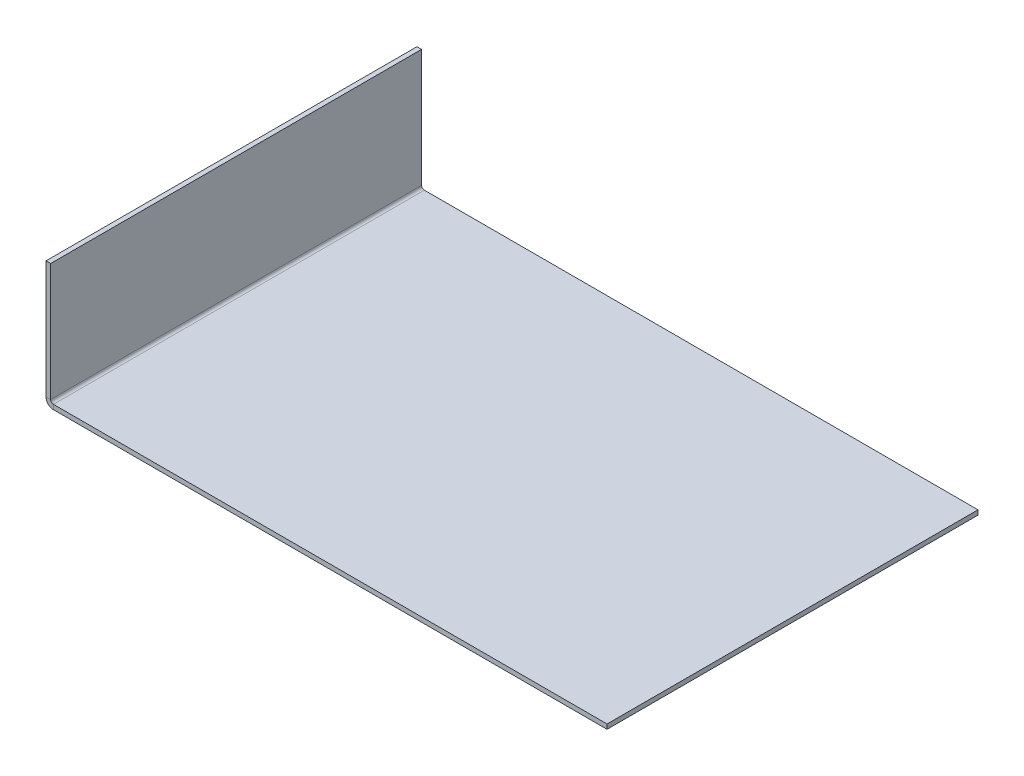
ISO-10303-21;
HEADER;
FILE_DESCRIPTION(('STEP AP214'),'2;1');
FILE_NAME('part.step','',(''),(''),'','','');
FILE_SCHEMA(('AUTOMOTIVE_DESIGN { 1 0 10303 214 1 1 1 1 }'));
ENDSEC;
DATA;
#1=APPLICATION_CONTEXT('core data for automotive mechanical design processes');
#2=APPLICATION_PROTOCOL_DEFINITION('international standard','automotive_design',2000,#1);
#3=PRODUCT_CONTEXT('',#1,'mechanical');
#4=PRODUCT('Part','Part','',(#3));
#5=PRODUCT_RELATED_PRODUCT_CATEGORY('part','',(#4));
#6=PRODUCT_DEFINITION_FORMATION('','',#4);
#7=PRODUCT_DEFINITION_CONTEXT('part definition',#1,'design');
#8=PRODUCT_DEFINITION('design','',#6,#7);
#9=PRODUCT_DEFINITION_SHAPE('','',#8);
#10=(LENGTH_UNIT() NAMED_UNIT(*) SI_UNIT(.MILLI.,.METRE.));
#11=(NAMED_UNIT(*) PLANE_ANGLE_UNIT() SI_UNIT($,.RADIAN.));
#12=(NAMED_UNIT(*) SI_UNIT($,.STERADIAN.) SOLID_ANGLE_UNIT());
#13=UNCERTAINTY_MEASURE_WITH_UNIT(LENGTH_MEASURE(1.E-05),#10,'distance_accuracy_value','');
#14=(GEOMETRIC_REPRESENTATION_CONTEXT(3) GLOBAL_UNCERTAINTY_ASSIGNED_CONTEXT((#13)) GLOBAL_UNIT_ASSIGNED_CONTEXT((#10,
#11,#12)) REPRESENTATION_CONTEXT('',''));
#15=CARTESIAN_POINT('',(0.,0.,0.));
#16=DIRECTION('',(0.,0.,1.));
#17=DIRECTION('',(1.,0.,0.));
#18=AXIS2_PLACEMENT_3D('',#15,#16,#17);
#19=CARTESIAN_POINT('',(-76.2,1.27,50.8));
#20=DIRECTION('',(0.,0.,-1.));
#21=DIRECTION('',(-1.,0.,0.));
#22=AXIS2_PLACEMENT_3D('',#19,#20,#21);
#23=PLANE('',#22);
#24=DIRECTION('',(0.,-1.,0.));
#25=VECTOR('',#24,1.);
#26=CARTESIAN_POINT('',(-75.438,1.27,50.8));
#27=LINE('',#26,#25);
#28=CARTESIAN_POINT('',(-75.438,1.27,50.8));
#29=VERTEX_POINT('',#28);
#30=CARTESIAN_POINT('',(-75.438,0.,50.8));
#31=VERTEX_POINT('',#30);
#32=EDGE_CURVE('E147',#29,#31,#27,.T.);
#33=ORIENTED_EDGE('',*,*,#32,.T.);
#34=DIRECTION('',(1.,0.,0.));
#35=VECTOR('',#34,1.);
#36=CARTESIAN_POINT('',(-76.2,0.,50.8));
#37=LINE('',#36,#35);
#38=CARTESIAN_POINT('',(76.2,0.,50.8));
#39=VERTEX_POINT('',#38);
#40=EDGE_CURVE('E150',#31,#39,#37,.T.);
#41=ORIENTED_EDGE('',*,*,#40,.T.);
#42=DIRECTION('',(0.,-1.,0.));
#43=VECTOR('',#42,1.);
#44=CARTESIAN_POINT('',(76.2,1.27,50.8));
#45=LINE('',#44,#43);
#46=CARTESIAN_POINT('',(76.2,1.27,50.8));
#47=VERTEX_POINT('',#46);
#48=EDGE_CURVE('E11',#47,#39,#45,.T.);
#49=ORIENTED_EDGE('',*,*,#48,.F.);
#50=DIRECTION('',(1.,0.,0.));
#51=VECTOR('',#50,1.);
#52=CARTESIAN_POINT('',(-76.2,1.27,50.8));
#53=LINE('',#52,#51);
#54=EDGE_CURVE('E157',#29,#47,#53,.T.);
#55=ORIENTED_EDGE('',*,*,#54,.F.);
#56=EDGE_LOOP('',(#33,#41,#49,#55));
#57=FACE_BOUND('',#56,.T.);
#58=ADVANCED_FACE('F28',(#57),#23,.F.);
#59=CARTESIAN_POINT('',(-76.2,1.27,-50.8));
#60=DIRECTION('',(0.,0.,1.));
#61=DIRECTION('',(1.,0.,0.));
#62=AXIS2_PLACEMENT_3D('',#59,#60,#61);
#63=PLANE('',#62);
#64=DIRECTION('',(0.,-1.,0.));
#65=VECTOR('',#64,1.);
#66=CARTESIAN_POINT('',(-75.438,1.27,-50.8));
#67=LINE('',#66,#65);
#68=CARTESIAN_POINT('',(-75.438,1.27,-50.8));
#69=VERTEX_POINT('',#68);
#70=CARTESIAN_POINT('',(-75.438,0.,-50.8));
#71=VERTEX_POINT('',#70);
#72=EDGE_CURVE('E42',#69,#71,#67,.T.);
#73=ORIENTED_EDGE('',*,*,#72,.F.);
#74=DIRECTION('',(-1.,0.,0.));
#75=VECTOR('',#74,1.);
#76=CARTESIAN_POINT('',(-76.2,1.27,-50.8));
#77=LINE('',#76,#75);
#78=CARTESIAN_POINT('',(76.2,1.27,-50.8));
#79=VERTEX_POINT('',#78);
#80=EDGE_CURVE('E161',#79,#69,#77,.T.);
#81=ORIENTED_EDGE('',*,*,#80,.F.);
#82=DIRECTION('',(0.,-1.,0.));
#83=VECTOR('',#82,1.);
#84=CARTESIAN_POINT('',(76.2,1.27,-50.8));
#85=LINE('',#84,#83);
#86=CARTESIAN_POINT('',(76.2,0.,-50.8));
#87=VERTEX_POINT('',#86);
#88=EDGE_CURVE('E35',#79,#87,#85,.T.);
#89=ORIENTED_EDGE('',*,*,#88,.T.);
#90=DIRECTION('',(-1.,0.,0.));
#91=VECTOR('',#90,1.);
#92=CARTESIAN_POINT('',(-76.2,0.,-50.8));
#93=LINE('',#92,#91);
#94=EDGE_CURVE('E155',#87,#71,#93,.T.);
#95=ORIENTED_EDGE('',*,*,#94,.T.);
#96=EDGE_LOOP('',(#73,#81,#89,#95));
#97=FACE_BOUND('',#96,.T.);
#98=ADVANCED_FACE('F165',(#97),#63,.F.);
#99=CARTESIAN_POINT('',(-76.2,1.27,50.8));
#100=DIRECTION('',(0.,1.,0.));
#101=DIRECTION('',(0.,0.,1.));
#102=AXIS2_PLACEMENT_3D('',#99,#100,#101);
#103=PLANE('',#102);
#104=ORIENTED_EDGE('',*,*,#80,.T.);
#105=DIRECTION('',(0.,0.,1.));
#106=VECTOR('',#105,1.);
#107=CARTESIAN_POINT('',(-75.438,1.27,50.8));
#108=LINE('',#107,#106);
#109=EDGE_CURVE('E49',#29,#69,#108,.F.);
#110=ORIENTED_EDGE('',*,*,#109,.F.);
#111=ORIENTED_EDGE('',*,*,#54,.T.);
#112=DIRECTION('',(0.,0.,-1.));
#113=VECTOR('',#112,1.);
#114=CARTESIAN_POINT('',(76.2,1.27,-50.8));
#115=LINE('',#114,#113);
#116=EDGE_CURVE('E159',#47,#79,#115,.T.);
#117=ORIENTED_EDGE('',*,*,#116,.T.);
#118=EDGE_LOOP('',(#104,#110,#111,#117));
#119=FACE_BOUND('',#118,.T.);
#120=ADVANCED_FACE('F175',(#119),#103,.T.);
#121=CARTESIAN_POINT('',(-76.2,0.,50.8));
#122=DIRECTION('',(0.,1.,0.));
#123=DIRECTION('',(0.,0.,1.));
#124=AXIS2_PLACEMENT_3D('',#121,#122,#123);
#125=PLANE('',#124);
#126=DIRECTION('',(0.,0.,1.));
#127=VECTOR('',#126,1.);
#128=CARTESIAN_POINT('',(-75.438,0.,50.8));
#129=LINE('',#128,#127);
#130=EDGE_CURVE('E101',#31,#71,#129,.F.);
#131=ORIENTED_EDGE('',*,*,#130,.T.);
#132=ORIENTED_EDGE('',*,*,#94,.F.);
#133=DIRECTION('',(0.,0.,-1.));
#134=VECTOR('',#133,1.);
#135=CARTESIAN_POINT('',(76.2,0.,-50.8));
#136=LINE('',#135,#134);
#137=EDGE_CURVE('E153',#39,#87,#136,.T.);
#138=ORIENTED_EDGE('',*,*,#137,.F.);
#139=ORIENTED_EDGE('',*,*,#40,.F.);
#140=EDGE_LOOP('',(#131,#132,#138,#139));
#141=FACE_BOUND('',#140,.T.);
#142=ADVANCED_FACE('F170',(#141),#125,.F.);
#143=CARTESIAN_POINT('',(76.2,1.27,-50.8));
#144=DIRECTION('',(-1.,0.,0.));
#145=DIRECTION('',(0.,0.,1.));
#146=AXIS2_PLACEMENT_3D('',#143,#144,#145);
#147=PLANE('',#146);
#148=ORIENTED_EDGE('',*,*,#137,.T.);
#149=ORIENTED_EDGE('',*,*,#88,.F.);
#150=ORIENTED_EDGE('',*,*,#116,.F.);
#151=ORIENTED_EDGE('',*,*,#48,.T.);
#152=EDGE_LOOP('',(#148,#149,#150,#151));
#153=FACE_BOUND('',#152,.T.);
#154=ADVANCED_FACE('F174',(#153),#147,.F.);
#155=CARTESIAN_POINT('',(-75.438,2.03199999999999,-50.8));
#156=DIRECTION('',(0.,0.,-1.));
#157=DIRECTION('',(-1.,0.,0.));
#158=AXIS2_PLACEMENT_3D('',#155,#156,#157);
#159=PLANE('',#158);
#160=DIRECTION('',(-1.,0.,0.));
#161=VECTOR('',#160,1.);
#162=CARTESIAN_POINT('',(-76.2,2.03199999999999,-50.8));
#163=LINE('',#162,#161);
#164=CARTESIAN_POINT('',(-76.2,2.03199999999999,-50.8));
#165=VERTEX_POINT('',#164);
#166=CARTESIAN_POINT('',(-77.47,2.03199999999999,-50.8));
#167=VERTEX_POINT('',#166);
#168=EDGE_CURVE('E183',#165,#167,#163,.T.);
#169=ORIENTED_EDGE('',*,*,#168,.F.);
#170=CARTESIAN_POINT('',(-75.438,2.03199999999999,-50.8));
#171=DIRECTION('',(0.,0.,1.));
#172=DIRECTION('',(1.,0.,0.));
#173=AXIS2_PLACEMENT_3D('',#170,#171,#172);
#174=CIRCLE('',#173,0.761999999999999);
#175=EDGE_CURVE('E104',#69,#165,#174,.F.);
#176=ORIENTED_EDGE('',*,*,#175,.F.);
#177=ORIENTED_EDGE('',*,*,#72,.T.);
#178=CARTESIAN_POINT('',(-75.438,2.03199999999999,-50.8));
#179=DIRECTION('',(0.,0.,1.));
#180=DIRECTION('',(1.,0.,0.));
#181=AXIS2_PLACEMENT_3D('',#178,#179,#180);
#182=CIRCLE('',#181,2.032);
#183=EDGE_CURVE('E146',#71,#167,#182,.F.);
#184=ORIENTED_EDGE('',*,*,#183,.T.);
#185=EDGE_LOOP('',(#169,#176,#177,#184));
#186=FACE_BOUND('',#185,.T.);
#187=ADVANCED_FACE('F216',(#186),#159,.T.);
#188=CARTESIAN_POINT('',(-75.438,2.03199999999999,50.8));
#189=DIRECTION('',(0.,0.,-1.));
#190=DIRECTION('',(-1.,0.,0.));
#191=AXIS2_PLACEMENT_3D('',#188,#189,#190);
#192=PLANE('',#191);
#193=CARTESIAN_POINT('',(-75.438,2.03199999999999,50.8));
#194=DIRECTION('',(0.,0.,1.));
#195=DIRECTION('',(1.,0.,0.));
#196=AXIS2_PLACEMENT_3D('',#193,#194,#195);
#197=CIRCLE('',#196,0.761999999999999);
#198=CARTESIAN_POINT('',(-76.2,2.03199999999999,50.8));
#199=VERTEX_POINT('',#198);
#200=EDGE_CURVE('E111',#199,#29,#197,.T.);
#201=ORIENTED_EDGE('',*,*,#200,.F.);
#202=DIRECTION('',(-1.,0.,0.));
#203=VECTOR('',#202,1.);
#204=CARTESIAN_POINT('',(-76.2,2.03199999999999,50.8));
#205=LINE('',#204,#203);
#206=CARTESIAN_POINT('',(-77.47,2.03199999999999,50.8));
#207=VERTEX_POINT('',#206);
#208=EDGE_CURVE('E108',#199,#207,#205,.T.);
#209=ORIENTED_EDGE('',*,*,#208,.T.);
#210=CARTESIAN_POINT('',(-75.438,2.03199999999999,50.8));
#211=DIRECTION('',(0.,0.,1.));
#212=DIRECTION('',(1.,0.,0.));
#213=AXIS2_PLACEMENT_3D('',#210,#211,#212);
#214=CIRCLE('',#213,2.032);
#215=EDGE_CURVE('E94',#207,#31,#214,.T.);
#216=ORIENTED_EDGE('',*,*,#215,.T.);
#217=ORIENTED_EDGE('',*,*,#32,.F.);
#218=EDGE_LOOP('',(#201,#209,#216,#217));
#219=FACE_BOUND('',#218,.T.);
#220=ADVANCED_FACE('F109',(#219),#192,.F.);
#221=CARTESIAN_POINT('',(-75.438,2.03199999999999,50.8));
#222=DIRECTION('',(0.,0.,1.));
#223=DIRECTION('',(-1.,0.,0.));
#224=AXIS2_PLACEMENT_3D('',#221,#222,#223);
#225=CYLINDRICAL_SURFACE('',#224,2.032);
#226=ORIENTED_EDGE('',*,*,#130,.F.);
#227=ORIENTED_EDGE('',*,*,#215,.F.);
#228=DIRECTION('',(0.,0.,-1.));
#229=VECTOR('',#228,1.);
#230=CARTESIAN_POINT('',(-77.47,2.03199999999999,-50.8));
#231=LINE('',#230,#229);
#232=EDGE_CURVE('E99',#207,#167,#231,.T.);
#233=ORIENTED_EDGE('',*,*,#232,.T.);
#234=ORIENTED_EDGE('',*,*,#183,.F.);
#235=EDGE_LOOP('',(#226,#227,#233,#234));
#236=FACE_BOUND('',#235,.T.);
#237=ADVANCED_FACE('F96',(#236),#225,.T.);
#238=CARTESIAN_POINT('',(-75.438,2.03199999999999,50.8));
#239=DIRECTION('',(0.,0.,1.));
#240=DIRECTION('',(-1.,0.,0.));
#241=AXIS2_PLACEMENT_3D('',#238,#239,#240);
#242=CYLINDRICAL_SURFACE('',#241,0.761999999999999);
#243=ORIENTED_EDGE('',*,*,#109,.T.);
#244=ORIENTED_EDGE('',*,*,#175,.T.);
#245=DIRECTION('',(0.,0.,1.));
#246=VECTOR('',#245,1.);
#247=CARTESIAN_POINT('',(-76.2,2.03199999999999,-50.8));
#248=LINE('',#247,#246);
#249=EDGE_CURVE('E115',#165,#199,#248,.T.);
#250=ORIENTED_EDGE('',*,*,#249,.T.);
#251=ORIENTED_EDGE('',*,*,#200,.T.);
#252=EDGE_LOOP('',(#243,#244,#250,#251));
#253=FACE_BOUND('',#252,.T.);
#254=ADVANCED_FACE('F177',(#253),#242,.F.);
#255=CARTESIAN_POINT('',(-77.47,1.27,-50.8));
#256=DIRECTION('',(0.,0.,1.));
#257=DIRECTION('',(1.,0.,0.));
#258=AXIS2_PLACEMENT_3D('',#255,#256,#257);
#259=PLANE('',#258);
#260=ORIENTED_EDGE('',*,*,#168,.T.);
#261=DIRECTION('',(0.,-1.,0.));
#262=VECTOR('',#261,1.);
#263=CARTESIAN_POINT('',(-77.47,1.27,-50.8));
#264=LINE('',#263,#262);
#265=CARTESIAN_POINT('',(-77.4700000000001,34.29,-50.8));
#266=VERTEX_POINT('',#265);
#267=EDGE_CURVE('E123',#266,#167,#264,.T.);
#268=ORIENTED_EDGE('',*,*,#267,.F.);
#269=DIRECTION('',(1.,0.,0.));
#270=VECTOR('',#269,1.);
#271=CARTESIAN_POINT('',(-77.4700000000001,34.29,-50.8));
#272=LINE('',#271,#270);
#273=CARTESIAN_POINT('',(-76.2000000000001,34.29,-50.8));
#274=VERTEX_POINT('',#273);
#275=EDGE_CURVE('E132',#266,#274,#272,.T.);
#276=ORIENTED_EDGE('',*,*,#275,.T.);
#277=DIRECTION('',(0.,-1.,0.));
#278=VECTOR('',#277,1.);
#279=CARTESIAN_POINT('',(-76.2,1.27,-50.8));
#280=LINE('',#279,#278);
#281=EDGE_CURVE('E124',#274,#165,#280,.T.);
#282=ORIENTED_EDGE('',*,*,#281,.T.);
#283=EDGE_LOOP('',(#260,#268,#276,#282));
#284=FACE_BOUND('',#283,.T.);
#285=ADVANCED_FACE('F195',(#284),#259,.F.);
#286=CARTESIAN_POINT('',(-77.4700000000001,34.29,50.8));
#287=DIRECTION('',(0.,0.,-1.));
#288=DIRECTION('',(-1.,0.,0.));
#289=AXIS2_PLACEMENT_3D('',#286,#287,#288);
#290=PLANE('',#289);
#291=ORIENTED_EDGE('',*,*,#208,.F.);
#292=DIRECTION('',(0.,1.,0.));
#293=VECTOR('',#292,1.);
#294=CARTESIAN_POINT('',(-76.2000000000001,34.29,50.8));
#295=LINE('',#294,#293);
#296=CARTESIAN_POINT('',(-76.2000000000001,34.29,50.8));
#297=VERTEX_POINT('',#296);
#298=EDGE_CURVE('E189',#199,#297,#295,.T.);
#299=ORIENTED_EDGE('',*,*,#298,.T.);
#300=DIRECTION('',(1.,0.,0.));
#301=VECTOR('',#300,1.);
#302=CARTESIAN_POINT('',(-77.4700000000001,34.29,50.8));
#303=LINE('',#302,#301);
#304=CARTESIAN_POINT('',(-77.4700000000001,34.29,50.8));
#305=VERTEX_POINT('',#304);
#306=EDGE_CURVE('E128',#305,#297,#303,.T.);
#307=ORIENTED_EDGE('',*,*,#306,.F.);
#308=DIRECTION('',(0.,1.,0.));
#309=VECTOR('',#308,1.);
#310=CARTESIAN_POINT('',(-77.4700000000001,34.29,50.8));
#311=LINE('',#310,#309);
#312=EDGE_CURVE('E120',#207,#305,#311,.T.);
#313=ORIENTED_EDGE('',*,*,#312,.F.);
#314=EDGE_LOOP('',(#291,#299,#307,#313));
#315=FACE_BOUND('',#314,.T.);
#316=ADVANCED_FACE('F126',(#315),#290,.F.);
#317=CARTESIAN_POINT('',(-77.4700000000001,34.29,-50.8));
#318=DIRECTION('',(1.,0.,0.));
#319=DIRECTION('',(0.,1.,0.));
#320=AXIS2_PLACEMENT_3D('',#317,#318,#319);
#321=PLANE('',#320);
#322=ORIENTED_EDGE('',*,*,#232,.F.);
#323=ORIENTED_EDGE('',*,*,#312,.T.);
#324=DIRECTION('',(0.,0.,-1.));
#325=VECTOR('',#324,1.);
#326=CARTESIAN_POINT('',(-77.4700000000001,34.29,-50.8));
#327=LINE('',#326,#325);
#328=EDGE_CURVE('E130',#305,#266,#327,.T.);
#329=ORIENTED_EDGE('',*,*,#328,.T.);
#330=ORIENTED_EDGE('',*,*,#267,.T.);
#331=EDGE_LOOP('',(#322,#323,#329,#330));
#332=FACE_BOUND('',#331,.T.);
#333=ADVANCED_FACE('F119',(#332),#321,.F.);
#334=CARTESIAN_POINT('',(-76.2000000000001,34.29,-50.8));
#335=DIRECTION('',(1.,0.,0.));
#336=DIRECTION('',(0.,1.,0.));
#337=AXIS2_PLACEMENT_3D('',#334,#335,#336);
#338=PLANE('',#337);
#339=ORIENTED_EDGE('',*,*,#298,.F.);
#340=ORIENTED_EDGE('',*,*,#249,.F.);
#341=ORIENTED_EDGE('',*,*,#281,.F.);
#342=DIRECTION('',(0.,0.,-1.));
#343=VECTOR('',#342,1.);
#344=CARTESIAN_POINT('',(-76.2000000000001,34.29,-50.8));
#345=LINE('',#344,#343);
#346=EDGE_CURVE('E134',#297,#274,#345,.T.);
#347=ORIENTED_EDGE('',*,*,#346,.F.);
#348=EDGE_LOOP('',(#339,#340,#341,#347));
#349=FACE_BOUND('',#348,.T.);
#350=ADVANCED_FACE('F196',(#349),#338,.T.);
#351=CARTESIAN_POINT('',(-77.4700000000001,34.29,-50.8));
#352=DIRECTION('',(0.,-1.,0.));
#353=DIRECTION('',(1.,0.,0.));
#354=AXIS2_PLACEMENT_3D('',#351,#352,#353);
#355=PLANE('',#354);
#356=ORIENTED_EDGE('',*,*,#346,.T.);
#357=ORIENTED_EDGE('',*,*,#275,.F.);
#358=ORIENTED_EDGE('',*,*,#328,.F.);
#359=ORIENTED_EDGE('',*,*,#306,.T.);
#360=EDGE_LOOP('',(#356,#357,#358,#359));
#361=FACE_BOUND('',#360,.T.);
#362=ADVANCED_FACE('F193',(#361),#355,.F.);
#363=CLOSED_SHELL('',(#58,#98,#120,#142,#154,#187,#220,#237,#254,#285,#316,#333,#350,#362));
#364=MANIFOLD_SOLID_BREP('B2',#363);
#365=ADVANCED_BREP_SHAPE_REPRESENTATION('',(#18,#364),#14);
#366=SHAPE_DEFINITION_REPRESENTATION(#9,#365);
ENDSEC;
END-ISO-10303-21;
